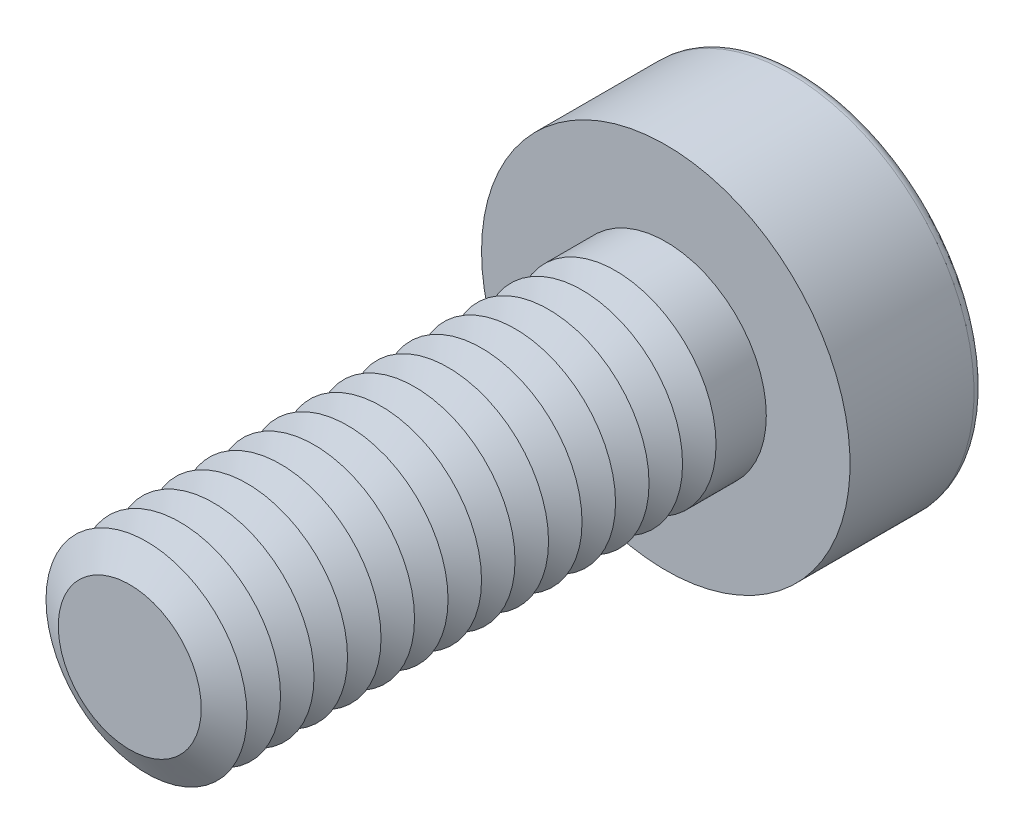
ISO-10303-21;
HEADER;
FILE_DESCRIPTION(('STEP AP214'),'2;1');
FILE_NAME('part.step','',(''),(''),'','','');
FILE_SCHEMA(('AUTOMOTIVE_DESIGN { 1 0 10303 214 1 1 1 1 }'));
ENDSEC;
DATA;
#1=APPLICATION_CONTEXT('core data for automotive mechanical design processes');
#2=APPLICATION_PROTOCOL_DEFINITION('international standard','automotive_design',2000,#1);
#3=PRODUCT_CONTEXT('',#1,'mechanical');
#4=PRODUCT('Part','Part','',(#3));
#5=PRODUCT_RELATED_PRODUCT_CATEGORY('part','',(#4));
#6=PRODUCT_DEFINITION_FORMATION('','',#4);
#7=PRODUCT_DEFINITION_CONTEXT('part definition',#1,'design');
#8=PRODUCT_DEFINITION('design','',#6,#7);
#9=PRODUCT_DEFINITION_SHAPE('','',#8);
#10=(LENGTH_UNIT() NAMED_UNIT(*) SI_UNIT(.MILLI.,.METRE.));
#11=(NAMED_UNIT(*) PLANE_ANGLE_UNIT() SI_UNIT($,.RADIAN.));
#12=(NAMED_UNIT(*) SI_UNIT($,.STERADIAN.) SOLID_ANGLE_UNIT());
#13=UNCERTAINTY_MEASURE_WITH_UNIT(LENGTH_MEASURE(1.E-05),#10,'distance_accuracy_value','');
#14=(GEOMETRIC_REPRESENTATION_CONTEXT(3) GLOBAL_UNCERTAINTY_ASSIGNED_CONTEXT((#13)) GLOBAL_UNIT_ASSIGNED_CONTEXT((#10,
#11,#12)) REPRESENTATION_CONTEXT('',''));
#15=CARTESIAN_POINT('',(0.,0.,0.));
#16=DIRECTION('',(0.,0.,1.));
#17=DIRECTION('',(1.,0.,0.));
#18=AXIS2_PLACEMENT_3D('',#15,#16,#17);
#19=CARTESIAN_POINT('',(0.,0.,6.25));
#20=DIRECTION('',(0.,0.,1.));
#21=DIRECTION('',(1.,0.,0.));
#22=AXIS2_PLACEMENT_3D('',#19,#20,#21);
#23=CONICAL_SURFACE('',#22,1.5,1.0471975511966);
#24=CARTESIAN_POINT('',(0.,0.,6.));
#25=DIRECTION('',(0.,0.,1.));
#26=DIRECTION('',(1.,0.,0.));
#27=AXIS2_PLACEMENT_3D('',#24,#25,#26);
#28=CIRCLE('',#27,1.06698729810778);
#29=CARTESIAN_POINT('',(1.06698729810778,0.,6.));
#30=VERTEX_POINT('',#29);
#31=EDGE_CURVE('E314',#30,#30,#28,.T.);
#32=ORIENTED_EDGE('',*,*,#31,.T.);
#33=EDGE_LOOP('',(#32));
#34=FACE_BOUND('',#33,.T.);
#35=CARTESIAN_POINT('',(0.,0.,6.25));
#36=DIRECTION('',(0.,0.,1.));
#37=DIRECTION('',(1.,0.,0.));
#38=AXIS2_PLACEMENT_3D('',#35,#36,#37);
#39=CIRCLE('',#38,1.5);
#40=CARTESIAN_POINT('',(1.5,0.,6.25));
#41=VERTEX_POINT('',#40);
#42=EDGE_CURVE('E316',#41,#41,#39,.T.);
#43=ORIENTED_EDGE('',*,*,#42,.F.);
#44=EDGE_LOOP('',(#43));
#45=FACE_BOUND('',#44,.T.);
#46=ADVANCED_FACE('F39',(#34,#45),#23,.T.);
#47=CARTESIAN_POINT('',(0.,0.,6.));
#48=DIRECTION('',(0.,0.,-1.));
#49=DIRECTION('',(-1.,0.,0.));
#50=AXIS2_PLACEMENT_3D('',#47,#48,#49);
#51=CONICAL_SURFACE('',#50,1.06698729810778,1.0471975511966);
#52=CARTESIAN_POINT('',(0.,0.,5.75));
#53=DIRECTION('',(0.,0.,1.));
#54=DIRECTION('',(1.,0.,0.));
#55=AXIS2_PLACEMENT_3D('',#52,#53,#54);
#56=CIRCLE('',#55,1.5);
#57=CARTESIAN_POINT('',(1.5,0.,5.75));
#58=VERTEX_POINT('',#57);
#59=EDGE_CURVE('E323',#58,#58,#56,.T.);
#60=ORIENTED_EDGE('',*,*,#59,.T.);
#61=EDGE_LOOP('',(#60));
#62=FACE_BOUND('',#61,.T.);
#63=ORIENTED_EDGE('',*,*,#31,.F.);
#64=EDGE_LOOP('',(#63));
#65=FACE_BOUND('',#64,.T.);
#66=ADVANCED_FACE('F245',(#62,#65),#51,.T.);
#67=CARTESIAN_POINT('',(0.,0.,8.));
#68=DIRECTION('',(0.,0.,1.));
#69=DIRECTION('',(1.,0.,0.));
#70=AXIS2_PLACEMENT_3D('',#67,#68,#69);
#71=PLANE('',#70);
#72=CARTESIAN_POINT('',(0.,0.,8.));
#73=DIRECTION('',(0.,0.,1.));
#74=DIRECTION('',(1.,0.,0.));
#75=AXIS2_PLACEMENT_3D('',#72,#73,#74);
#76=CIRCLE('',#75,1.06698729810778);
#77=CARTESIAN_POINT('',(1.06698729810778,0.,8.));
#78=VERTEX_POINT('',#77);
#79=EDGE_CURVE('E174',#78,#78,#76,.T.);
#80=ORIENTED_EDGE('',*,*,#79,.T.);
#81=EDGE_LOOP('',(#80));
#82=FACE_BOUND('',#81,.T.);
#83=ADVANCED_FACE('F251',(#82),#71,.T.);
#84=CARTESIAN_POINT('',(0.,0.,8.));
#85=DIRECTION('',(0.,0.,-1.));
#86=DIRECTION('',(-1.,0.,0.));
#87=AXIS2_PLACEMENT_3D('',#84,#85,#86);
#88=CONICAL_SURFACE('',#87,1.06698729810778,1.0471975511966);
#89=CARTESIAN_POINT('',(0.,0.,7.75));
#90=DIRECTION('',(0.,0.,1.));
#91=DIRECTION('',(1.,0.,0.));
#92=AXIS2_PLACEMENT_3D('',#89,#90,#91);
#93=CIRCLE('',#92,1.5);
#94=CARTESIAN_POINT('',(1.5,0.,7.75));
#95=VERTEX_POINT('',#94);
#96=EDGE_CURVE('E291',#95,#95,#93,.T.);
#97=ORIENTED_EDGE('',*,*,#96,.T.);
#98=EDGE_LOOP('',(#97));
#99=FACE_BOUND('',#98,.T.);
#100=ORIENTED_EDGE('',*,*,#79,.F.);
#101=EDGE_LOOP('',(#100));
#102=FACE_BOUND('',#101,.T.);
#103=ADVANCED_FACE('F199',(#99,#102),#88,.T.);
#104=CARTESIAN_POINT('',(0.,0.,7.75));
#105=DIRECTION('',(0.,0.,1.));
#106=DIRECTION('',(1.,0.,0.));
#107=AXIS2_PLACEMENT_3D('',#104,#105,#106);
#108=CONICAL_SURFACE('',#107,1.5,1.0471975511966);
#109=CARTESIAN_POINT('',(0.,0.,7.5));
#110=DIRECTION('',(0.,0.,1.));
#111=DIRECTION('',(1.,0.,0.));
#112=AXIS2_PLACEMENT_3D('',#109,#110,#111);
#113=CIRCLE('',#112,1.06698729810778);
#114=CARTESIAN_POINT('',(1.06698729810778,0.,7.5));
#115=VERTEX_POINT('',#114);
#116=EDGE_CURVE('E288',#115,#115,#113,.T.);
#117=ORIENTED_EDGE('',*,*,#116,.T.);
#118=EDGE_LOOP('',(#117));
#119=FACE_BOUND('',#118,.T.);
#120=ORIENTED_EDGE('',*,*,#96,.F.);
#121=EDGE_LOOP('',(#120));
#122=FACE_BOUND('',#121,.T.);
#123=ADVANCED_FACE('F277',(#119,#122),#108,.T.);
#124=CARTESIAN_POINT('',(0.,0.,7.5));
#125=DIRECTION('',(0.,0.,-1.));
#126=DIRECTION('',(-1.,0.,0.));
#127=AXIS2_PLACEMENT_3D('',#124,#125,#126);
#128=CONICAL_SURFACE('',#127,1.06698729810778,1.0471975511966);
#129=CARTESIAN_POINT('',(0.,0.,7.25));
#130=DIRECTION('',(0.,0.,1.));
#131=DIRECTION('',(1.,0.,0.));
#132=AXIS2_PLACEMENT_3D('',#129,#130,#131);
#133=CIRCLE('',#132,1.5);
#134=CARTESIAN_POINT('',(1.5,0.,7.25));
#135=VERTEX_POINT('',#134);
#136=EDGE_CURVE('E300',#135,#135,#133,.T.);
#137=ORIENTED_EDGE('',*,*,#136,.T.);
#138=EDGE_LOOP('',(#137));
#139=FACE_BOUND('',#138,.T.);
#140=ORIENTED_EDGE('',*,*,#116,.F.);
#141=EDGE_LOOP('',(#140));
#142=FACE_BOUND('',#141,.T.);
#143=ADVANCED_FACE('F274',(#139,#142),#128,.T.);
#144=CARTESIAN_POINT('',(0.,0.,7.25));
#145=DIRECTION('',(0.,0.,1.));
#146=DIRECTION('',(1.,0.,0.));
#147=AXIS2_PLACEMENT_3D('',#144,#145,#146);
#148=CONICAL_SURFACE('',#147,1.5,1.0471975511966);
#149=CARTESIAN_POINT('',(0.,0.,7.));
#150=DIRECTION('',(0.,0.,1.));
#151=DIRECTION('',(1.,0.,0.));
#152=AXIS2_PLACEMENT_3D('',#149,#150,#151);
#153=CIRCLE('',#152,1.06698729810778);
#154=CARTESIAN_POINT('',(1.06698729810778,0.,7.));
#155=VERTEX_POINT('',#154);
#156=EDGE_CURVE('E293',#155,#155,#153,.T.);
#157=ORIENTED_EDGE('',*,*,#156,.T.);
#158=EDGE_LOOP('',(#157));
#159=FACE_BOUND('',#158,.T.);
#160=ORIENTED_EDGE('',*,*,#136,.F.);
#161=EDGE_LOOP('',(#160));
#162=FACE_BOUND('',#161,.T.);
#163=ADVANCED_FACE('F270',(#159,#162),#148,.T.);
#164=CARTESIAN_POINT('',(0.,0.,7.));
#165=DIRECTION('',(0.,0.,-1.));
#166=DIRECTION('',(-1.,0.,0.));
#167=AXIS2_PLACEMENT_3D('',#164,#165,#166);
#168=CONICAL_SURFACE('',#167,1.06698729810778,1.0471975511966);
#169=CARTESIAN_POINT('',(0.,0.,6.75));
#170=DIRECTION('',(0.,0.,1.));
#171=DIRECTION('',(1.,0.,0.));
#172=AXIS2_PLACEMENT_3D('',#169,#170,#171);
#173=CIRCLE('',#172,1.5);
#174=CARTESIAN_POINT('',(1.5,0.,6.75));
#175=VERTEX_POINT('',#174);
#176=EDGE_CURVE('E310',#175,#175,#173,.T.);
#177=ORIENTED_EDGE('',*,*,#176,.T.);
#178=EDGE_LOOP('',(#177));
#179=FACE_BOUND('',#178,.T.);
#180=ORIENTED_EDGE('',*,*,#156,.F.);
#181=EDGE_LOOP('',(#180));
#182=FACE_BOUND('',#181,.T.);
#183=ADVANCED_FACE('F266',(#179,#182),#168,.T.);
#184=CARTESIAN_POINT('',(0.,0.,6.75));
#185=DIRECTION('',(0.,0.,1.));
#186=DIRECTION('',(1.,0.,0.));
#187=AXIS2_PLACEMENT_3D('',#184,#185,#186);
#188=CONICAL_SURFACE('',#187,1.5,1.0471975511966);
#189=CARTESIAN_POINT('',(0.,0.,6.5));
#190=DIRECTION('',(0.,0.,1.));
#191=DIRECTION('',(1.,0.,0.));
#192=AXIS2_PLACEMENT_3D('',#189,#190,#191);
#193=CIRCLE('',#192,1.06698729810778);
#194=CARTESIAN_POINT('',(1.06698729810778,0.,6.5));
#195=VERTEX_POINT('',#194);
#196=EDGE_CURVE('E306',#195,#195,#193,.T.);
#197=ORIENTED_EDGE('',*,*,#196,.T.);
#198=EDGE_LOOP('',(#197));
#199=FACE_BOUND('',#198,.T.);
#200=ORIENTED_EDGE('',*,*,#176,.F.);
#201=EDGE_LOOP('',(#200));
#202=FACE_BOUND('',#201,.T.);
#203=ADVANCED_FACE('F262',(#199,#202),#188,.T.);
#204=CARTESIAN_POINT('',(0.,0.,6.5));
#205=DIRECTION('',(0.,0.,-1.));
#206=DIRECTION('',(-1.,0.,0.));
#207=AXIS2_PLACEMENT_3D('',#204,#205,#206);
#208=CONICAL_SURFACE('',#207,1.06698729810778,1.0471975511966);
#209=ORIENTED_EDGE('',*,*,#42,.T.);
#210=EDGE_LOOP('',(#209));
#211=FACE_BOUND('',#210,.T.);
#212=ORIENTED_EDGE('',*,*,#196,.F.);
#213=EDGE_LOOP('',(#212));
#214=FACE_BOUND('',#213,.T.);
#215=ADVANCED_FACE('F258',(#211,#214),#208,.T.);
#216=CARTESIAN_POINT('',(0.,0.,5.75));
#217=DIRECTION('',(0.,0.,1.));
#218=DIRECTION('',(1.,0.,0.));
#219=AXIS2_PLACEMENT_3D('',#216,#217,#218);
#220=CONICAL_SURFACE('',#219,1.5,1.0471975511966);
#221=CARTESIAN_POINT('',(0.,0.,5.5));
#222=DIRECTION('',(0.,0.,1.));
#223=DIRECTION('',(1.,0.,0.));
#224=AXIS2_PLACEMENT_3D('',#221,#222,#223);
#225=CIRCLE('',#224,1.06698729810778);
#226=CARTESIAN_POINT('',(1.06698729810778,0.,5.5));
#227=VERTEX_POINT('',#226);
#228=EDGE_CURVE('E319',#227,#227,#225,.T.);
#229=ORIENTED_EDGE('',*,*,#228,.T.);
#230=EDGE_LOOP('',(#229));
#231=FACE_BOUND('',#230,.T.);
#232=ORIENTED_EDGE('',*,*,#59,.F.);
#233=EDGE_LOOP('',(#232));
#234=FACE_BOUND('',#233,.T.);
#235=ADVANCED_FACE('F261',(#231,#234),#220,.T.);
#236=CARTESIAN_POINT('',(0.,0.,5.5));
#237=DIRECTION('',(0.,0.,-1.));
#238=DIRECTION('',(-1.,0.,0.));
#239=AXIS2_PLACEMENT_3D('',#236,#237,#238);
#240=CONICAL_SURFACE('',#239,1.06698729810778,1.0471975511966);
#241=CARTESIAN_POINT('',(0.,0.,5.25));
#242=DIRECTION('',(0.,0.,1.));
#243=DIRECTION('',(1.,0.,0.));
#244=AXIS2_PLACEMENT_3D('',#241,#242,#243);
#245=CIRCLE('',#244,1.5);
#246=CARTESIAN_POINT('',(1.5,0.,5.25));
#247=VERTEX_POINT('',#246);
#248=EDGE_CURVE('E331',#247,#247,#245,.T.);
#249=ORIENTED_EDGE('',*,*,#248,.T.);
#250=EDGE_LOOP('',(#249));
#251=FACE_BOUND('',#250,.T.);
#252=ORIENTED_EDGE('',*,*,#228,.F.);
#253=EDGE_LOOP('',(#252));
#254=FACE_BOUND('',#253,.T.);
#255=ADVANCED_FACE('F479',(#251,#254),#240,.T.);
#256=CARTESIAN_POINT('',(0.,0.,5.25));
#257=DIRECTION('',(0.,0.,1.));
#258=DIRECTION('',(1.,0.,0.));
#259=AXIS2_PLACEMENT_3D('',#256,#257,#258);
#260=CONICAL_SURFACE('',#259,1.5,1.0471975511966);
#261=CARTESIAN_POINT('',(0.,0.,5.));
#262=DIRECTION('',(0.,0.,1.));
#263=DIRECTION('',(1.,0.,0.));
#264=AXIS2_PLACEMENT_3D('',#261,#262,#263);
#265=CIRCLE('',#264,1.06698729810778);
#266=CARTESIAN_POINT('',(1.06698729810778,0.,5.));
#267=VERTEX_POINT('',#266);
#268=EDGE_CURVE('E327',#267,#267,#265,.T.);
#269=ORIENTED_EDGE('',*,*,#268,.T.);
#270=EDGE_LOOP('',(#269));
#271=FACE_BOUND('',#270,.T.);
#272=ORIENTED_EDGE('',*,*,#248,.F.);
#273=EDGE_LOOP('',(#272));
#274=FACE_BOUND('',#273,.T.);
#275=ADVANCED_FACE('F475',(#271,#274),#260,.T.);
#276=CARTESIAN_POINT('',(0.,0.,5.));
#277=DIRECTION('',(0.,0.,-1.));
#278=DIRECTION('',(-1.,0.,0.));
#279=AXIS2_PLACEMENT_3D('',#276,#277,#278);
#280=CONICAL_SURFACE('',#279,1.06698729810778,1.0471975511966);
#281=CARTESIAN_POINT('',(0.,0.,4.75));
#282=DIRECTION('',(0.,0.,1.));
#283=DIRECTION('',(1.,0.,0.));
#284=AXIS2_PLACEMENT_3D('',#281,#282,#283);
#285=CIRCLE('',#284,1.5);
#286=CARTESIAN_POINT('',(1.5,0.,4.75));
#287=VERTEX_POINT('',#286);
#288=EDGE_CURVE('E339',#287,#287,#285,.T.);
#289=ORIENTED_EDGE('',*,*,#288,.T.);
#290=EDGE_LOOP('',(#289));
#291=FACE_BOUND('',#290,.T.);
#292=ORIENTED_EDGE('',*,*,#268,.F.);
#293=EDGE_LOOP('',(#292));
#294=FACE_BOUND('',#293,.T.);
#295=ADVANCED_FACE('F471',(#291,#294),#280,.T.);
#296=CARTESIAN_POINT('',(0.,0.,4.75));
#297=DIRECTION('',(0.,0.,1.));
#298=DIRECTION('',(1.,0.,0.));
#299=AXIS2_PLACEMENT_3D('',#296,#297,#298);
#300=CONICAL_SURFACE('',#299,1.5,1.0471975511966);
#301=CARTESIAN_POINT('',(0.,0.,4.5));
#302=DIRECTION('',(0.,0.,1.));
#303=DIRECTION('',(1.,0.,0.));
#304=AXIS2_PLACEMENT_3D('',#301,#302,#303);
#305=CIRCLE('',#304,1.06698729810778);
#306=CARTESIAN_POINT('',(1.06698729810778,0.,4.5));
#307=VERTEX_POINT('',#306);
#308=EDGE_CURVE('E335',#307,#307,#305,.T.);
#309=ORIENTED_EDGE('',*,*,#308,.T.);
#310=EDGE_LOOP('',(#309));
#311=FACE_BOUND('',#310,.T.);
#312=ORIENTED_EDGE('',*,*,#288,.F.);
#313=EDGE_LOOP('',(#312));
#314=FACE_BOUND('',#313,.T.);
#315=ADVANCED_FACE('F467',(#311,#314),#300,.T.);
#316=CARTESIAN_POINT('',(0.,0.,4.5));
#317=DIRECTION('',(0.,0.,-1.));
#318=DIRECTION('',(-1.,0.,0.));
#319=AXIS2_PLACEMENT_3D('',#316,#317,#318);
#320=CONICAL_SURFACE('',#319,1.06698729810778,1.0471975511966);
#321=CARTESIAN_POINT('',(0.,0.,4.25));
#322=DIRECTION('',(0.,0.,1.));
#323=DIRECTION('',(1.,0.,0.));
#324=AXIS2_PLACEMENT_3D('',#321,#322,#323);
#325=CIRCLE('',#324,1.5);
#326=CARTESIAN_POINT('',(1.5,0.,4.25));
#327=VERTEX_POINT('',#326);
#328=EDGE_CURVE('E347',#327,#327,#325,.T.);
#329=ORIENTED_EDGE('',*,*,#328,.T.);
#330=EDGE_LOOP('',(#329));
#331=FACE_BOUND('',#330,.T.);
#332=ORIENTED_EDGE('',*,*,#308,.F.);
#333=EDGE_LOOP('',(#332));
#334=FACE_BOUND('',#333,.T.);
#335=ADVANCED_FACE('F463',(#331,#334),#320,.T.);
#336=CARTESIAN_POINT('',(0.,0.,4.25));
#337=DIRECTION('',(0.,0.,1.));
#338=DIRECTION('',(1.,0.,0.));
#339=AXIS2_PLACEMENT_3D('',#336,#337,#338);
#340=CONICAL_SURFACE('',#339,1.5,1.0471975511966);
#341=CARTESIAN_POINT('',(0.,0.,4.));
#342=DIRECTION('',(0.,0.,1.));
#343=DIRECTION('',(1.,0.,0.));
#344=AXIS2_PLACEMENT_3D('',#341,#342,#343);
#345=CIRCLE('',#344,1.06698729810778);
#346=CARTESIAN_POINT('',(1.06698729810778,0.,4.));
#347=VERTEX_POINT('',#346);
#348=EDGE_CURVE('E343',#347,#347,#345,.T.);
#349=ORIENTED_EDGE('',*,*,#348,.T.);
#350=EDGE_LOOP('',(#349));
#351=FACE_BOUND('',#350,.T.);
#352=ORIENTED_EDGE('',*,*,#328,.F.);
#353=EDGE_LOOP('',(#352));
#354=FACE_BOUND('',#353,.T.);
#355=ADVANCED_FACE('F459',(#351,#354),#340,.T.);
#356=CARTESIAN_POINT('',(0.,0.,4.));
#357=DIRECTION('',(0.,0.,-1.));
#358=DIRECTION('',(-1.,0.,0.));
#359=AXIS2_PLACEMENT_3D('',#356,#357,#358);
#360=CONICAL_SURFACE('',#359,1.06698729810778,1.0471975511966);
#361=CARTESIAN_POINT('',(0.,0.,3.75));
#362=DIRECTION('',(0.,0.,1.));
#363=DIRECTION('',(1.,0.,0.));
#364=AXIS2_PLACEMENT_3D('',#361,#362,#363);
#365=CIRCLE('',#364,1.5);
#366=CARTESIAN_POINT('',(1.5,0.,3.75));
#367=VERTEX_POINT('',#366);
#368=EDGE_CURVE('E355',#367,#367,#365,.T.);
#369=ORIENTED_EDGE('',*,*,#368,.T.);
#370=EDGE_LOOP('',(#369));
#371=FACE_BOUND('',#370,.T.);
#372=ORIENTED_EDGE('',*,*,#348,.F.);
#373=EDGE_LOOP('',(#372));
#374=FACE_BOUND('',#373,.T.);
#375=ADVANCED_FACE('F455',(#371,#374),#360,.T.);
#376=CARTESIAN_POINT('',(0.,0.,3.75));
#377=DIRECTION('',(0.,0.,1.));
#378=DIRECTION('',(1.,0.,0.));
#379=AXIS2_PLACEMENT_3D('',#376,#377,#378);
#380=CONICAL_SURFACE('',#379,1.5,1.0471975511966);
#381=CARTESIAN_POINT('',(0.,0.,3.5));
#382=DIRECTION('',(0.,0.,1.));
#383=DIRECTION('',(1.,0.,0.));
#384=AXIS2_PLACEMENT_3D('',#381,#382,#383);
#385=CIRCLE('',#384,1.06698729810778);
#386=CARTESIAN_POINT('',(1.06698729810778,0.,3.5));
#387=VERTEX_POINT('',#386);
#388=EDGE_CURVE('E351',#387,#387,#385,.T.);
#389=ORIENTED_EDGE('',*,*,#388,.T.);
#390=EDGE_LOOP('',(#389));
#391=FACE_BOUND('',#390,.T.);
#392=ORIENTED_EDGE('',*,*,#368,.F.);
#393=EDGE_LOOP('',(#392));
#394=FACE_BOUND('',#393,.T.);
#395=ADVANCED_FACE('F451',(#391,#394),#380,.T.);
#396=CARTESIAN_POINT('',(0.,0.,3.5));
#397=DIRECTION('',(0.,0.,-1.));
#398=DIRECTION('',(-1.,0.,0.));
#399=AXIS2_PLACEMENT_3D('',#396,#397,#398);
#400=CONICAL_SURFACE('',#399,1.06698729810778,1.0471975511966);
#401=CARTESIAN_POINT('',(0.,0.,3.25));
#402=DIRECTION('',(0.,0.,1.));
#403=DIRECTION('',(1.,0.,0.));
#404=AXIS2_PLACEMENT_3D('',#401,#402,#403);
#405=CIRCLE('',#404,1.5);
#406=CARTESIAN_POINT('',(1.5,0.,3.25));
#407=VERTEX_POINT('',#406);
#408=EDGE_CURVE('E363',#407,#407,#405,.T.);
#409=ORIENTED_EDGE('',*,*,#408,.T.);
#410=EDGE_LOOP('',(#409));
#411=FACE_BOUND('',#410,.T.);
#412=ORIENTED_EDGE('',*,*,#388,.F.);
#413=EDGE_LOOP('',(#412));
#414=FACE_BOUND('',#413,.T.);
#415=ADVANCED_FACE('F447',(#411,#414),#400,.T.);
#416=CARTESIAN_POINT('',(0.,0.,3.25));
#417=DIRECTION('',(0.,0.,1.));
#418=DIRECTION('',(1.,0.,0.));
#419=AXIS2_PLACEMENT_3D('',#416,#417,#418);
#420=CONICAL_SURFACE('',#419,1.5,1.0471975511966);
#421=CARTESIAN_POINT('',(0.,0.,3.));
#422=DIRECTION('',(0.,0.,1.));
#423=DIRECTION('',(1.,0.,0.));
#424=AXIS2_PLACEMENT_3D('',#421,#422,#423);
#425=CIRCLE('',#424,1.06698729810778);
#426=CARTESIAN_POINT('',(1.06698729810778,0.,3.));
#427=VERTEX_POINT('',#426);
#428=EDGE_CURVE('E359',#427,#427,#425,.T.);
#429=ORIENTED_EDGE('',*,*,#428,.T.);
#430=EDGE_LOOP('',(#429));
#431=FACE_BOUND('',#430,.T.);
#432=ORIENTED_EDGE('',*,*,#408,.F.);
#433=EDGE_LOOP('',(#432));
#434=FACE_BOUND('',#433,.T.);
#435=ADVANCED_FACE('F443',(#431,#434),#420,.T.);
#436=CARTESIAN_POINT('',(0.,0.,3.));
#437=DIRECTION('',(0.,0.,-1.));
#438=DIRECTION('',(-1.,0.,0.));
#439=AXIS2_PLACEMENT_3D('',#436,#437,#438);
#440=CONICAL_SURFACE('',#439,1.06698729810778,1.0471975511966);
#441=CARTESIAN_POINT('',(0.,0.,2.75));
#442=DIRECTION('',(0.,0.,1.));
#443=DIRECTION('',(1.,0.,0.));
#444=AXIS2_PLACEMENT_3D('',#441,#442,#443);
#445=CIRCLE('',#444,1.5);
#446=CARTESIAN_POINT('',(1.5,0.,2.75));
#447=VERTEX_POINT('',#446);
#448=EDGE_CURVE('E371',#447,#447,#445,.T.);
#449=ORIENTED_EDGE('',*,*,#448,.T.);
#450=EDGE_LOOP('',(#449));
#451=FACE_BOUND('',#450,.T.);
#452=ORIENTED_EDGE('',*,*,#428,.F.);
#453=EDGE_LOOP('',(#452));
#454=FACE_BOUND('',#453,.T.);
#455=ADVANCED_FACE('F439',(#451,#454),#440,.T.);
#456=CARTESIAN_POINT('',(0.,0.,2.75));
#457=DIRECTION('',(0.,0.,1.));
#458=DIRECTION('',(1.,0.,0.));
#459=AXIS2_PLACEMENT_3D('',#456,#457,#458);
#460=CONICAL_SURFACE('',#459,1.5,1.0471975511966);
#461=CARTESIAN_POINT('',(0.,0.,2.5));
#462=DIRECTION('',(0.,0.,1.));
#463=DIRECTION('',(1.,0.,0.));
#464=AXIS2_PLACEMENT_3D('',#461,#462,#463);
#465=CIRCLE('',#464,1.06698729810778);
#466=CARTESIAN_POINT('',(1.06698729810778,0.,2.5));
#467=VERTEX_POINT('',#466);
#468=EDGE_CURVE('E367',#467,#467,#465,.T.);
#469=ORIENTED_EDGE('',*,*,#468,.T.);
#470=EDGE_LOOP('',(#469));
#471=FACE_BOUND('',#470,.T.);
#472=ORIENTED_EDGE('',*,*,#448,.F.);
#473=EDGE_LOOP('',(#472));
#474=FACE_BOUND('',#473,.T.);
#475=ADVANCED_FACE('F435',(#471,#474),#460,.T.);
#476=CARTESIAN_POINT('',(0.,0.,2.5));
#477=DIRECTION('',(0.,0.,-1.));
#478=DIRECTION('',(-1.,0.,0.));
#479=AXIS2_PLACEMENT_3D('',#476,#477,#478);
#480=CONICAL_SURFACE('',#479,1.06698729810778,1.0471975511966);
#481=CARTESIAN_POINT('',(0.,0.,2.25));
#482=DIRECTION('',(0.,0.,1.));
#483=DIRECTION('',(1.,0.,0.));
#484=AXIS2_PLACEMENT_3D('',#481,#482,#483);
#485=CIRCLE('',#484,1.5);
#486=CARTESIAN_POINT('',(1.5,0.,2.25));
#487=VERTEX_POINT('',#486);
#488=EDGE_CURVE('E379',#487,#487,#485,.T.);
#489=ORIENTED_EDGE('',*,*,#488,.T.);
#490=EDGE_LOOP('',(#489));
#491=FACE_BOUND('',#490,.T.);
#492=ORIENTED_EDGE('',*,*,#468,.F.);
#493=EDGE_LOOP('',(#492));
#494=FACE_BOUND('',#493,.T.);
#495=ADVANCED_FACE('F431',(#491,#494),#480,.T.);
#496=CARTESIAN_POINT('',(0.,0.,2.25));
#497=DIRECTION('',(0.,0.,1.));
#498=DIRECTION('',(1.,0.,0.));
#499=AXIS2_PLACEMENT_3D('',#496,#497,#498);
#500=CONICAL_SURFACE('',#499,1.5,1.0471975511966);
#501=CARTESIAN_POINT('',(0.,0.,2.));
#502=DIRECTION('',(0.,0.,1.));
#503=DIRECTION('',(1.,0.,0.));
#504=AXIS2_PLACEMENT_3D('',#501,#502,#503);
#505=CIRCLE('',#504,1.06698729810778);
#506=CARTESIAN_POINT('',(1.06698729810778,0.,2.));
#507=VERTEX_POINT('',#506);
#508=EDGE_CURVE('E375',#507,#507,#505,.T.);
#509=ORIENTED_EDGE('',*,*,#508,.T.);
#510=EDGE_LOOP('',(#509));
#511=FACE_BOUND('',#510,.T.);
#512=ORIENTED_EDGE('',*,*,#488,.F.);
#513=EDGE_LOOP('',(#512));
#514=FACE_BOUND('',#513,.T.);
#515=ADVANCED_FACE('F427',(#511,#514),#500,.T.);
#516=CARTESIAN_POINT('',(0.,0.,2.));
#517=DIRECTION('',(0.,0.,-1.));
#518=DIRECTION('',(-1.,0.,0.));
#519=AXIS2_PLACEMENT_3D('',#516,#517,#518);
#520=CONICAL_SURFACE('',#519,1.06698729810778,1.0471975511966);
#521=CARTESIAN_POINT('',(0.,0.,1.75));
#522=DIRECTION('',(0.,0.,1.));
#523=DIRECTION('',(1.,0.,0.));
#524=AXIS2_PLACEMENT_3D('',#521,#522,#523);
#525=CIRCLE('',#524,1.5);
#526=CARTESIAN_POINT('',(1.5,0.,1.75));
#527=VERTEX_POINT('',#526);
#528=EDGE_CURVE('E387',#527,#527,#525,.T.);
#529=ORIENTED_EDGE('',*,*,#528,.T.);
#530=EDGE_LOOP('',(#529));
#531=FACE_BOUND('',#530,.T.);
#532=ORIENTED_EDGE('',*,*,#508,.F.);
#533=EDGE_LOOP('',(#532));
#534=FACE_BOUND('',#533,.T.);
#535=ADVANCED_FACE('F423',(#531,#534),#520,.T.);
#536=CARTESIAN_POINT('',(0.,0.,1.75));
#537=DIRECTION('',(0.,0.,1.));
#538=DIRECTION('',(1.,0.,0.));
#539=AXIS2_PLACEMENT_3D('',#536,#537,#538);
#540=CONICAL_SURFACE('',#539,1.5,1.0471975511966);
#541=CARTESIAN_POINT('',(0.,0.,1.5));
#542=DIRECTION('',(0.,0.,1.));
#543=DIRECTION('',(1.,0.,0.));
#544=AXIS2_PLACEMENT_3D('',#541,#542,#543);
#545=CIRCLE('',#544,1.06698729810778);
#546=CARTESIAN_POINT('',(1.06698729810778,0.,1.5));
#547=VERTEX_POINT('',#546);
#548=EDGE_CURVE('E383',#547,#547,#545,.T.);
#549=ORIENTED_EDGE('',*,*,#548,.T.);
#550=EDGE_LOOP('',(#549));
#551=FACE_BOUND('',#550,.T.);
#552=ORIENTED_EDGE('',*,*,#528,.F.);
#553=EDGE_LOOP('',(#552));
#554=FACE_BOUND('',#553,.T.);
#555=ADVANCED_FACE('F418',(#551,#554),#540,.T.);
#556=CARTESIAN_POINT('',(0.,0.,1.5));
#557=DIRECTION('',(0.,0.,-1.));
#558=DIRECTION('',(-1.,0.,0.));
#559=AXIS2_PLACEMENT_3D('',#556,#557,#558);
#560=CONICAL_SURFACE('',#559,1.06698729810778,1.0471975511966);
#561=CARTESIAN_POINT('',(0.,0.,1.25));
#562=DIRECTION('',(0.,0.,1.));
#563=DIRECTION('',(1.,0.,0.));
#564=AXIS2_PLACEMENT_3D('',#561,#562,#563);
#565=CIRCLE('',#564,1.5);
#566=CARTESIAN_POINT('',(1.5,0.,1.25));
#567=VERTEX_POINT('',#566);
#568=EDGE_CURVE('E398',#567,#567,#565,.T.);
#569=ORIENTED_EDGE('',*,*,#568,.T.);
#570=EDGE_LOOP('',(#569));
#571=FACE_BOUND('',#570,.T.);
#572=ORIENTED_EDGE('',*,*,#548,.F.);
#573=EDGE_LOOP('',(#572));
#574=FACE_BOUND('',#573,.T.);
#575=ADVANCED_FACE('F404',(#571,#574),#560,.T.);
#576=CARTESIAN_POINT('',(0.,0.,1.25));
#577=DIRECTION('',(0.,0.,1.));
#578=DIRECTION('',(1.,0.,0.));
#579=AXIS2_PLACEMENT_3D('',#576,#577,#578);
#580=CONICAL_SURFACE('',#579,1.5,1.0471975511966);
#581=CARTESIAN_POINT('',(0.,0.,1.));
#582=DIRECTION('',(0.,0.,1.));
#583=DIRECTION('',(1.,0.,0.));
#584=AXIS2_PLACEMENT_3D('',#581,#582,#583);
#585=CIRCLE('',#584,1.06698729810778);
#586=CARTESIAN_POINT('',(1.06698729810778,0.,1.));
#587=VERTEX_POINT('',#586);
#588=EDGE_CURVE('E391',#587,#587,#585,.T.);
#589=ORIENTED_EDGE('',*,*,#588,.T.);
#590=EDGE_LOOP('',(#589));
#591=FACE_BOUND('',#590,.T.);
#592=ORIENTED_EDGE('',*,*,#568,.F.);
#593=EDGE_LOOP('',(#592));
#594=FACE_BOUND('',#593,.T.);
#595=ADVANCED_FACE('F407',(#591,#594),#580,.T.);
#596=CARTESIAN_POINT('',(0.,0.,1.));
#597=DIRECTION('',(0.,0.,-1.));
#598=DIRECTION('',(-1.,0.,0.));
#599=AXIS2_PLACEMENT_3D('',#596,#597,#598);
#600=CONICAL_SURFACE('',#599,1.06698729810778,1.0471975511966);
#601=CARTESIAN_POINT('',(0.,0.,0.75));
#602=DIRECTION('',(0.,0.,1.));
#603=DIRECTION('',(1.,0.,0.));
#604=AXIS2_PLACEMENT_3D('',#601,#602,#603);
#605=CIRCLE('',#604,1.5);
#606=CARTESIAN_POINT('',(1.5,0.,0.75));
#607=VERTEX_POINT('',#606);
#608=EDGE_CURVE('E395',#607,#607,#605,.T.);
#609=ORIENTED_EDGE('',*,*,#608,.T.);
#610=EDGE_LOOP('',(#609));
#611=FACE_BOUND('',#610,.T.);
#612=ORIENTED_EDGE('',*,*,#588,.F.);
#613=EDGE_LOOP('',(#612));
#614=FACE_BOUND('',#613,.T.);
#615=ADVANCED_FACE('F409',(#611,#614),#600,.T.);
#616=CARTESIAN_POINT('',(0.,0.,-0.5));
#617=DIRECTION('',(0.,0.,-1.));
#618=DIRECTION('',(-1.,0.,0.));
#619=AXIS2_PLACEMENT_3D('',#616,#617,#618);
#620=CONICAL_SURFACE('',#619,0.999999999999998,1.0471975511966);
#621=CARTESIAN_POINT('',(0.,0.,0.0773502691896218));
#622=VERTEX_POINT('',#621);
#623=VERTEX_LOOP('',#622);
#624=FACE_BOUND('',#623,.T.);
#625=CARTESIAN_POINT('',(0.,0.,-0.5));
#626=DIRECTION('',(0.,0.,-1.));
#627=DIRECTION('',(-1.,0.,0.));
#628=AXIS2_PLACEMENT_3D('',#625,#626,#627);
#629=CIRCLE('',#628,0.999999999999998);
#630=CARTESIAN_POINT('',(-0.866025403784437,0.499999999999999,-0.5));
#631=VERTEX_POINT('',#630);
#632=CARTESIAN_POINT('',(0.,0.999999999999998,-0.5));
#633=VERTEX_POINT('',#632);
#634=EDGE_CURVE('E149',#631,#633,#629,.T.);
#635=ORIENTED_EDGE('',*,*,#634,.T.);
#636=CARTESIAN_POINT('',(0.,0.,-0.5));
#637=DIRECTION('',(0.,0.,-1.));
#638=DIRECTION('',(-1.,0.,0.));
#639=AXIS2_PLACEMENT_3D('',#636,#637,#638);
#640=CIRCLE('',#639,0.999999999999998);
#641=CARTESIAN_POINT('',(0.866025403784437,0.499999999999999,-0.5));
#642=VERTEX_POINT('',#641);
#643=EDGE_CURVE('E54',#633,#642,#640,.T.);
#644=ORIENTED_EDGE('',*,*,#643,.T.);
#645=CARTESIAN_POINT('',(0.866025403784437,-0.499999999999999,-0.5));
#646=VERTEX_POINT('',#645);
#647=EDGE_CURVE('E968',#642,#646,#640,.T.);
#648=ORIENTED_EDGE('',*,*,#647,.T.);
#649=CARTESIAN_POINT('',(0.,-0.999999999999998,-0.5));
#650=VERTEX_POINT('',#649);
#651=EDGE_CURVE('E966',#646,#650,#640,.T.);
#652=ORIENTED_EDGE('',*,*,#651,.T.);
#653=CARTESIAN_POINT('',(-0.866025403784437,-0.499999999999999,-0.5));
#654=VERTEX_POINT('',#653);
#655=EDGE_CURVE('E960',#650,#654,#640,.T.);
#656=ORIENTED_EDGE('',*,*,#655,.T.);
#657=EDGE_CURVE('E958',#654,#631,#640,.T.);
#658=ORIENTED_EDGE('',*,*,#657,.T.);
#659=EDGE_LOOP('',(#635,#644,#648,#652,#656,#658));
#660=FACE_BOUND('',#659,.T.);
#661=ADVANCED_FACE('F201',(#624,#660),#620,.F.);
#662=CARTESIAN_POINT('',(0.,0.,-0.5));
#663=DIRECTION('',(0.,0.,-1.));
#664=DIRECTION('',(-1.,0.,0.));
#665=AXIS2_PLACEMENT_3D('',#662,#663,#664);
#666=PLANE('',#665);
#667=ORIENTED_EDGE('',*,*,#643,.F.);
#668=DIRECTION('',(1.,0.,0.));
#669=VECTOR('',#668,1.);
#670=CARTESIAN_POINT('',(-0.577350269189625,1.,-0.5));
#671=LINE('',#670,#669);
#672=CARTESIAN_POINT('',(0.577350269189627,1.,-0.5));
#673=VERTEX_POINT('',#672);
#674=EDGE_CURVE('E1007',#633,#673,#671,.T.);
#675=ORIENTED_EDGE('',*,*,#674,.T.);
#676=DIRECTION('',(0.5,-0.866025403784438,0.));
#677=VECTOR('',#676,1.);
#678=CARTESIAN_POINT('',(0.577350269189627,1.,-0.5));
#679=LINE('',#678,#677);
#680=EDGE_CURVE('E155',#673,#642,#679,.T.);
#681=ORIENTED_EDGE('',*,*,#680,.T.);
#682=EDGE_LOOP('',(#667,#675,#681));
#683=FACE_BOUND('',#682,.T.);
#684=ADVANCED_FACE('F562',(#683),#666,.T.);
#685=ORIENTED_EDGE('',*,*,#647,.F.);
#686=CARTESIAN_POINT('',(1.15470053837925,0.,-0.5));
#687=VERTEX_POINT('',#686);
#688=EDGE_CURVE('E1010',#642,#687,#679,.T.);
#689=ORIENTED_EDGE('',*,*,#688,.T.);
#690=DIRECTION('',(-0.5,-0.866025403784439,0.));
#691=VECTOR('',#690,1.);
#692=CARTESIAN_POINT('',(1.15470053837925,0.,-0.5));
#693=LINE('',#692,#691);
#694=EDGE_CURVE('E982',#687,#646,#693,.T.);
#695=ORIENTED_EDGE('',*,*,#694,.T.);
#696=EDGE_LOOP('',(#685,#689,#695));
#697=FACE_BOUND('',#696,.T.);
#698=ADVANCED_FACE('F572',(#697),#666,.T.);
#699=ORIENTED_EDGE('',*,*,#651,.F.);
#700=CARTESIAN_POINT('',(0.577350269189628,-1.,-0.5));
#701=VERTEX_POINT('',#700);
#702=EDGE_CURVE('E984',#646,#701,#693,.T.);
#703=ORIENTED_EDGE('',*,*,#702,.T.);
#704=DIRECTION('',(-1.,0.,0.));
#705=VECTOR('',#704,1.);
#706=CARTESIAN_POINT('',(0.577350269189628,-1.,-0.5));
#707=LINE('',#706,#705);
#708=EDGE_CURVE('E932',#701,#650,#707,.T.);
#709=ORIENTED_EDGE('',*,*,#708,.T.);
#710=EDGE_LOOP('',(#699,#703,#709));
#711=FACE_BOUND('',#710,.T.);
#712=ADVANCED_FACE('F582',(#711),#666,.T.);
#713=ORIENTED_EDGE('',*,*,#655,.F.);
#714=CARTESIAN_POINT('',(-0.577350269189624,-0.999999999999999,-0.5));
#715=VERTEX_POINT('',#714);
#716=EDGE_CURVE('E978',#650,#715,#707,.T.);
#717=ORIENTED_EDGE('',*,*,#716,.T.);
#718=DIRECTION('',(-0.5,0.866025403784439,0.));
#719=VECTOR('',#718,1.);
#720=CARTESIAN_POINT('',(-0.577350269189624,-0.999999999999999,-0.5));
#721=LINE('',#720,#719);
#722=EDGE_CURVE('E980',#715,#654,#721,.T.);
#723=ORIENTED_EDGE('',*,*,#722,.T.);
#724=EDGE_LOOP('',(#713,#717,#723));
#725=FACE_BOUND('',#724,.T.);
#726=ADVANCED_FACE('F590',(#725),#666,.T.);
#727=ORIENTED_EDGE('',*,*,#657,.F.);
#728=CARTESIAN_POINT('',(-1.15470053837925,0.,-0.5));
#729=VERTEX_POINT('',#728);
#730=EDGE_CURVE('E985',#654,#729,#721,.T.);
#731=ORIENTED_EDGE('',*,*,#730,.T.);
#732=DIRECTION('',(0.5,0.866025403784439,0.));
#733=VECTOR('',#732,1.);
#734=CARTESIAN_POINT('',(-1.15470053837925,0.,-0.5));
#735=LINE('',#734,#733);
#736=EDGE_CURVE('E158',#729,#631,#735,.T.);
#737=ORIENTED_EDGE('',*,*,#736,.T.);
#738=EDGE_LOOP('',(#727,#731,#737));
#739=FACE_BOUND('',#738,.T.);
#740=ADVANCED_FACE('F231',(#739),#666,.T.);
#741=ORIENTED_EDGE('',*,*,#634,.F.);
#742=CARTESIAN_POINT('',(-0.577350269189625,1.,-0.5));
#743=VERTEX_POINT('',#742);
#744=EDGE_CURVE('E991',#631,#743,#735,.T.);
#745=ORIENTED_EDGE('',*,*,#744,.T.);
#746=EDGE_CURVE('E1005',#743,#633,#671,.T.);
#747=ORIENTED_EDGE('',*,*,#746,.T.);
#748=EDGE_LOOP('',(#741,#745,#747));
#749=FACE_BOUND('',#748,.T.);
#750=ADVANCED_FACE('F574',(#749),#666,.T.);
#751=CARTESIAN_POINT('',(-0.577350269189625,1.,-0.5));
#752=DIRECTION('',(0.,1.,0.));
#753=DIRECTION('',(0.,0.,1.));
#754=AXIS2_PLACEMENT_3D('',#751,#752,#753);
#755=PLANE('',#754);
#756=DIRECTION('',(0.,0.,-1.));
#757=VECTOR('',#756,1.);
#758=CARTESIAN_POINT('',(-0.577350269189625,1.,-0.5));
#759=LINE('',#758,#757);
#760=CARTESIAN_POINT('',(-0.577350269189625,1.,-2.));
#761=VERTEX_POINT('',#760);
#762=EDGE_CURVE('E147',#743,#761,#759,.T.);
#763=ORIENTED_EDGE('',*,*,#762,.T.);
#764=CARTESIAN_POINT('',(-1.50720379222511,1.,-2.17525844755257));
#765=CARTESIAN_POINT('',(-1.46204888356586,1.,-2.16517814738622));
#766=CARTESIAN_POINT('',(-1.41686530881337,1.,-2.15522625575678));
#767=CARTESIAN_POINT('',(-1.32642642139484,1.,-2.13564428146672));
#768=CARTESIAN_POINT('',(-1.28117110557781,1.,-2.12601421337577));
#769=CARTESIAN_POINT('',(-1.14519006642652,1.,-2.09768643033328));
#770=CARTESIAN_POINT('',(-1.05434091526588,1.,-2.07957187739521));
#771=CARTESIAN_POINT('',(-0.87298578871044,1.,-2.04585879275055));
#772=CARTESIAN_POINT('',(-0.782483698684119,1.,-2.03023975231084));
#773=CARTESIAN_POINT('',(-0.600935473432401,1.,-2.00256781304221));
#774=CARTESIAN_POINT('',(-0.509889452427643,1.,-1.99051419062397));
#775=CARTESIAN_POINT('',(-0.326198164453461,1.,-1.9715245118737));
#776=CARTESIAN_POINT('',(-0.233546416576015,1.,-1.96464740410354));
#777=CARTESIAN_POINT('',(-0.0480110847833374,1.,-1.95773316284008));
#778=CARTESIAN_POINT('',(0.0448723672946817,1.,-1.95769276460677));
#779=CARTESIAN_POINT('',(0.230753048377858,1.,-1.96446847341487));
#780=CARTESIAN_POINT('',(0.323749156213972,1.,-1.97131296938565));
#781=CARTESIAN_POINT('',(0.509217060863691,1.,-1.99040362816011));
#782=CARTESIAN_POINT('',(0.601688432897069,1.,-2.00265366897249));
#783=CARTESIAN_POINT('',(0.788469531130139,1.,-2.0311825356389));
#784=CARTESIAN_POINT('',(0.882763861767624,1.,-2.04755860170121));
#785=CARTESIAN_POINT('',(1.07089474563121,1.,-2.08278522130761));
#786=CARTESIAN_POINT('',(1.16473122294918,1.,-2.1016361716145));
#787=CARTESIAN_POINT('',(1.35209202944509,1.,-2.14094224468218));
#788=CARTESIAN_POINT('',(1.44561626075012,1.,-2.16139782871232));
#789=CARTESIAN_POINT('',(1.63242626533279,1.,-2.20337233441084));
#790=CARTESIAN_POINT('',(1.72571203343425,1.,-2.22489127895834));
#791=CARTESIAN_POINT('',(1.91097396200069,1.,-2.26839206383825));
#792=CARTESIAN_POINT('',(2.00295221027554,1.,-2.29036504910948));
#793=CARTESIAN_POINT('',(2.18678775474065,1.,-2.3348190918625));
#794=CARTESIAN_POINT('',(2.27864504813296,1.,-2.35730016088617));
#795=CARTESIAN_POINT('',(2.46214009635,1.,-2.40260092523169));
#796=CARTESIAN_POINT('',(2.55377797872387,1.,-2.42542010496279));
#797=CARTESIAN_POINT('',(2.73697957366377,1.,-2.47134052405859));
#798=CARTESIAN_POINT('',(2.82854328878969,1.,-2.49444175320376));
#799=CARTESIAN_POINT('',(2.92008180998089,1.,-2.51764127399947));
#800=B_SPLINE_CURVE_WITH_KNOTS('',3,(#764,#765,#766,#767,#768,#769,#770,#771,#772,#773,#774,
#775,#776,#777,#778,#779,#780,#781,#782,#783,#784,#785,#786,#787,#788,#789,#790,#791,#792,#793,
#794,#795,#796,#797,#798,#799),.UNSPECIFIED.,.F.,.F.,(4,2,2,2,2,2,2,2,2,2,2,2,2,2,2,2,2,4),(0.,
0.138798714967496,0.277603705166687,0.555495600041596,0.830971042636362,1.106390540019,
1.38490086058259,1.66327818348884,1.94280808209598,2.22253884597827,2.50960639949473,
2.79672003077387,3.08391650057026,3.37111915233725,3.65481652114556,3.93852034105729,
4.22182877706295,4.50512697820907),.UNSPECIFIED.);
#801=CARTESIAN_POINT('',(0.577350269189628,0.999999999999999,-2.));
#802=VERTEX_POINT('',#801);
#803=EDGE_CURVE('E124',#761,#802,#800,.T.);
#804=ORIENTED_EDGE('',*,*,#803,.T.);
#805=DIRECTION('',(0.,0.,-1.));
#806=VECTOR('',#805,1.);
#807=CARTESIAN_POINT('',(0.577350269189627,1.,-0.5));
#808=LINE('',#807,#806);
#809=EDGE_CURVE('E143',#673,#802,#808,.T.);
#810=ORIENTED_EDGE('',*,*,#809,.F.);
#811=ORIENTED_EDGE('',*,*,#674,.F.);
#812=ORIENTED_EDGE('',*,*,#746,.F.);
#813=EDGE_LOOP('',(#763,#804,#810,#811,#812));
#814=FACE_BOUND('',#813,.T.);
#815=ADVANCED_FACE('F141',(#814),#755,.F.);
#816=CARTESIAN_POINT('',(0.577350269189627,1.,-0.5));
#817=DIRECTION('',(0.866025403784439,0.5,0.));
#818=DIRECTION('',(-0.5,0.866025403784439,0.));
#819=AXIS2_PLACEMENT_3D('',#816,#817,#818);
#820=PLANE('',#819);
#821=ORIENTED_EDGE('',*,*,#809,.T.);
#822=CARTESIAN_POINT('',(0.577234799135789,1.0002,-2.00003094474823));
#823=CARTESIAN_POINT('',(0.601220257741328,0.958655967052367,-1.99359970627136));
#824=CARTESIAN_POINT('',(0.625249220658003,0.917036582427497,-1.98776108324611));
#825=CARTESIAN_POINT('',(0.673392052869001,0.833650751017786,-1.97750302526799));
#826=CARTESIAN_POINT('',(0.697505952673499,0.79188425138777,-1.97308416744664));
#827=CARTESIAN_POINT('',(0.745672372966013,0.70845756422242,-1.96592373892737));
#828=CARTESIAN_POINT('',(0.769724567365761,0.666797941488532,-1.96317362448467));
#829=CARTESIAN_POINT('',(0.817859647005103,0.583425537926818,-1.95948598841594));
#830=CARTESIAN_POINT('',(0.841942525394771,0.541712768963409,-1.95854811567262));
#831=CARTESIAN_POINT('',(0.890108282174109,0.458287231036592,-1.95854811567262));
#832=CARTESIAN_POINT('',(0.914191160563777,0.416574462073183,-1.95948598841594));
#833=CARTESIAN_POINT('',(0.962326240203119,0.33320205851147,-1.96317362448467));
#834=CARTESIAN_POINT('',(0.986378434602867,0.291542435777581,-1.96592373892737));
#835=CARTESIAN_POINT('',(1.03454485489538,0.208115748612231,-1.97308416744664));
#836=CARTESIAN_POINT('',(1.05865875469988,0.166349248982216,-1.97750302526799));
#837=CARTESIAN_POINT('',(1.10680158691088,0.0829634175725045,-1.98776108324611));
#838=CARTESIAN_POINT('',(1.13083054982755,0.0413440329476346,-1.99359970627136));
#839=CARTESIAN_POINT('',(1.15481600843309,-0.000199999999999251,-2.00003094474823));
#840=B_SPLINE_CURVE_WITH_KNOTS('',3,(#822,#823,#824,#825,#826,#827,#828,#829,#830,#831,#832,
#833,#834,#835,#836,#837,#838,#839),.UNSPECIFIED.,.F.,.F.,(4,2,2,2,2,2,2,2,4),(0.,
0.145207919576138,0.290474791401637,0.434991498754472,0.579480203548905,0.723968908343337,
0.868485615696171,1.01375248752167,1.15896040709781),.UNSPECIFIED.);
#841=CARTESIAN_POINT('',(1.15470053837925,0.,-2.));
#842=VERTEX_POINT('',#841);
#843=EDGE_CURVE('E11',#802,#842,#840,.T.);
#844=ORIENTED_EDGE('',*,*,#843,.T.);
#845=DIRECTION('',(0.,0.,-1.));
#846=VECTOR('',#845,1.);
#847=CARTESIAN_POINT('',(1.15470053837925,0.,-0.5));
#848=LINE('',#847,#846);
#849=EDGE_CURVE('E157',#687,#842,#848,.T.);
#850=ORIENTED_EDGE('',*,*,#849,.F.);
#851=ORIENTED_EDGE('',*,*,#688,.F.);
#852=ORIENTED_EDGE('',*,*,#680,.F.);
#853=EDGE_LOOP('',(#821,#844,#850,#851,#852));
#854=FACE_BOUND('',#853,.T.);
#855=ADVANCED_FACE('F152',(#854),#820,.F.);
#856=CARTESIAN_POINT('',(1.15470053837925,0.,-0.5));
#857=DIRECTION('',(0.866025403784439,-0.5,0.));
#858=DIRECTION('',(0.5,0.866025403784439,0.));
#859=AXIS2_PLACEMENT_3D('',#856,#857,#858);
#860=PLANE('',#859);
#861=ORIENTED_EDGE('',*,*,#849,.T.);
#862=CARTESIAN_POINT('',(1.15481600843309,0.000200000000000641,-2.00003094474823));
#863=CARTESIAN_POINT('',(1.13083054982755,-0.0413440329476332,-1.99359970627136));
#864=CARTESIAN_POINT('',(1.10680158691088,-0.0829634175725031,-1.98776108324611));
#865=CARTESIAN_POINT('',(1.05865875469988,-0.166349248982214,-1.97750302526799));
#866=CARTESIAN_POINT('',(1.03454485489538,-0.20811574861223,-1.97308416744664));
#867=CARTESIAN_POINT('',(0.986378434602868,-0.29154243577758,-1.96592373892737));
#868=CARTESIAN_POINT('',(0.962326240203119,-0.333202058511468,-1.96317362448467));
#869=CARTESIAN_POINT('',(0.914191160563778,-0.416574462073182,-1.95948598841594));
#870=CARTESIAN_POINT('',(0.890108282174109,-0.458287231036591,-1.95854811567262));
#871=CARTESIAN_POINT('',(0.841942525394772,-0.541712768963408,-1.95854811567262));
#872=CARTESIAN_POINT('',(0.817859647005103,-0.583425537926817,-1.95948598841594));
#873=CARTESIAN_POINT('',(0.769724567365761,-0.66679794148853,-1.96317362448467));
#874=CARTESIAN_POINT('',(0.745672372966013,-0.708457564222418,-1.96592373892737));
#875=CARTESIAN_POINT('',(0.6975059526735,-0.791884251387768,-1.97308416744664));
#876=CARTESIAN_POINT('',(0.673392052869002,-0.833650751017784,-1.97750302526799));
#877=CARTESIAN_POINT('',(0.625249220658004,-0.917036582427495,-1.98776108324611));
#878=CARTESIAN_POINT('',(0.601220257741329,-0.958655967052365,-1.99359970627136));
#879=CARTESIAN_POINT('',(0.57723479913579,-1.0002,-2.00003094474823));
#880=B_SPLINE_CURVE_WITH_KNOTS('',3,(#862,#863,#864,#865,#866,#867,#868,#869,#870,#871,#872,
#873,#874,#875,#876,#877,#878,#879),.UNSPECIFIED.,.F.,.F.,(4,2,2,2,2,2,2,2,4),(0.,
0.145207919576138,0.290474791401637,0.434991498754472,0.579480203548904,0.723968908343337,
0.868485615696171,1.01375248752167,1.15896040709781),.UNSPECIFIED.);
#881=CARTESIAN_POINT('',(0.577350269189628,-0.999999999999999,-2.));
#882=VERTEX_POINT('',#881);
#883=EDGE_CURVE('E173',#842,#882,#880,.T.);
#884=ORIENTED_EDGE('',*,*,#883,.T.);
#885=DIRECTION('',(0.,0.,-1.));
#886=VECTOR('',#885,1.);
#887=CARTESIAN_POINT('',(0.577350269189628,-1.,-0.5));
#888=LINE('',#887,#886);
#889=EDGE_CURVE('E927',#701,#882,#888,.T.);
#890=ORIENTED_EDGE('',*,*,#889,.F.);
#891=ORIENTED_EDGE('',*,*,#702,.F.);
#892=ORIENTED_EDGE('',*,*,#694,.F.);
#893=EDGE_LOOP('',(#861,#884,#890,#891,#892));
#894=FACE_BOUND('',#893,.T.);
#895=ADVANCED_FACE('F191',(#894),#860,.F.);
#896=CARTESIAN_POINT('',(0.577350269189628,-1.,-0.5));
#897=DIRECTION('',(0.,-1.,0.));
#898=DIRECTION('',(1.,0.,0.));
#899=AXIS2_PLACEMENT_3D('',#896,#897,#898);
#900=PLANE('',#899);
#901=ORIENTED_EDGE('',*,*,#889,.T.);
#902=CARTESIAN_POINT('',(-1.50720379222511,-0.999999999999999,-2.17525844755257));
#903=CARTESIAN_POINT('',(-1.46204888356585,-0.999999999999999,-2.16517814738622));
#904=CARTESIAN_POINT('',(-1.41686530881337,-0.999999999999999,-2.15522625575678));
#905=CARTESIAN_POINT('',(-1.32642642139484,-0.999999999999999,-2.13564428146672));
#906=CARTESIAN_POINT('',(-1.28117110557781,-0.999999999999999,-2.12601421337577));
#907=CARTESIAN_POINT('',(-1.14519006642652,-0.999999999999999,-2.09768643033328));
#908=CARTESIAN_POINT('',(-1.05434091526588,-0.999999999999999,-2.07957187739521));
#909=CARTESIAN_POINT('',(-0.87298578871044,-0.999999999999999,-2.04585879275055));
#910=CARTESIAN_POINT('',(-0.782483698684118,-0.999999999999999,-2.03023975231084));
#911=CARTESIAN_POINT('',(-0.600935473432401,-0.999999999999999,-2.00256781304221));
#912=CARTESIAN_POINT('',(-0.509889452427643,-0.999999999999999,-1.99051419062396));
#913=CARTESIAN_POINT('',(-0.326198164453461,-0.999999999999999,-1.9715245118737));
#914=CARTESIAN_POINT('',(-0.233546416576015,-0.999999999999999,-1.96464740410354));
#915=CARTESIAN_POINT('',(-0.0480110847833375,-0.999999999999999,-1.95773316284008));
#916=CARTESIAN_POINT('',(0.0448723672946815,-0.999999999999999,-1.95769276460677));
#917=CARTESIAN_POINT('',(0.230753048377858,-0.999999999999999,-1.96446847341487));
#918=CARTESIAN_POINT('',(0.323749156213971,-1.,-1.97131296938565));
#919=CARTESIAN_POINT('',(0.50921706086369,-1.,-1.99040362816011));
#920=CARTESIAN_POINT('',(0.601688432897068,-1.,-2.00265366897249));
#921=CARTESIAN_POINT('',(0.788469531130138,-1.,-2.0311825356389));
#922=CARTESIAN_POINT('',(0.882763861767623,-1.,-2.04755860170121));
#923=CARTESIAN_POINT('',(1.07089474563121,-1.,-2.08278522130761));
#924=CARTESIAN_POINT('',(1.16473122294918,-1.,-2.1016361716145));
#925=CARTESIAN_POINT('',(1.35209202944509,-1.,-2.14094224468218));
#926=CARTESIAN_POINT('',(1.44561626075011,-1.,-2.16139782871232));
#927=CARTESIAN_POINT('',(1.63242626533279,-1.,-2.20337233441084));
#928=CARTESIAN_POINT('',(1.72571203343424,-1.,-2.22489127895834));
#929=CARTESIAN_POINT('',(1.91097396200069,-1.,-2.26839206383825));
#930=CARTESIAN_POINT('',(2.00295221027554,-1.,-2.29036504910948));
#931=CARTESIAN_POINT('',(2.18678775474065,-1.,-2.3348190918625));
#932=CARTESIAN_POINT('',(2.27864504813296,-1.,-2.35730016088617));
#933=CARTESIAN_POINT('',(2.46214009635,-1.,-2.40260092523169));
#934=CARTESIAN_POINT('',(2.55377797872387,-1.,-2.42542010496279));
#935=CARTESIAN_POINT('',(2.73697957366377,-1.,-2.47134052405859));
#936=CARTESIAN_POINT('',(2.82854328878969,-1.,-2.49444175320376));
#937=CARTESIAN_POINT('',(2.92008180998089,-1.,-2.51764127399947));
#938=B_SPLINE_CURVE_WITH_KNOTS('',3,(#902,#903,#904,#905,#906,#907,#908,#909,#910,#911,#912,
#913,#914,#915,#916,#917,#918,#919,#920,#921,#922,#923,#924,#925,#926,#927,#928,#929,#930,#931,
#932,#933,#934,#935,#936,#937),.UNSPECIFIED.,.F.,.F.,(4,2,2,2,2,2,2,2,2,2,2,2,2,2,2,2,2,4),(0.,
0.138798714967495,0.277603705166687,0.555495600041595,0.83097104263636,1.106390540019,
1.38490086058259,1.66327818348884,1.94280808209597,2.22253884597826,2.50960639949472,
2.79672003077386,3.08391650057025,3.37111915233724,3.65481652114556,3.93852034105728,
4.22182877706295,4.50512697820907),.UNSPECIFIED.);
#939=CARTESIAN_POINT('',(-0.577350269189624,-0.999999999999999,-2.));
#940=VERTEX_POINT('',#939);
#941=EDGE_CURVE('E184',#882,#940,#938,.F.);
#942=ORIENTED_EDGE('',*,*,#941,.T.);
#943=DIRECTION('',(0.,0.,-1.));
#944=VECTOR('',#943,1.);
#945=CARTESIAN_POINT('',(-0.577350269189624,-0.999999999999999,-0.5));
#946=LINE('',#945,#944);
#947=EDGE_CURVE('E934',#715,#940,#946,.T.);
#948=ORIENTED_EDGE('',*,*,#947,.F.);
#949=ORIENTED_EDGE('',*,*,#716,.F.);
#950=ORIENTED_EDGE('',*,*,#708,.F.);
#951=EDGE_LOOP('',(#901,#942,#948,#949,#950));
#952=FACE_BOUND('',#951,.T.);
#953=ADVANCED_FACE('F234',(#952),#900,.F.);
#954=CARTESIAN_POINT('',(-0.577350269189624,-0.999999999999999,-0.5));
#955=DIRECTION('',(-0.866025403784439,-0.5,0.));
#956=DIRECTION('',(0.5,-0.866025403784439,0.));
#957=AXIS2_PLACEMENT_3D('',#954,#955,#956);
#958=PLANE('',#957);
#959=ORIENTED_EDGE('',*,*,#947,.T.);
#960=CARTESIAN_POINT('',(-0.577234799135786,-1.0002,-2.00003094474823));
#961=CARTESIAN_POINT('',(-0.601220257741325,-0.958655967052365,-1.99359970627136));
#962=CARTESIAN_POINT('',(-0.625249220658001,-0.917036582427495,-1.98776108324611));
#963=CARTESIAN_POINT('',(-0.673392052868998,-0.833650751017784,-1.97750302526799));
#964=CARTESIAN_POINT('',(-0.697505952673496,-0.791884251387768,-1.97308416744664));
#965=CARTESIAN_POINT('',(-0.74567237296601,-0.708457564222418,-1.96592373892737));
#966=CARTESIAN_POINT('',(-0.769724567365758,-0.66679794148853,-1.96317362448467));
#967=CARTESIAN_POINT('',(-0.8178596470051,-0.583425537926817,-1.95948598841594));
#968=CARTESIAN_POINT('',(-0.841942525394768,-0.541712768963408,-1.95854811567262));
#969=CARTESIAN_POINT('',(-0.890108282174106,-0.45828723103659,-1.95854811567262));
#970=CARTESIAN_POINT('',(-0.914191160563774,-0.416574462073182,-1.95948598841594));
#971=CARTESIAN_POINT('',(-0.962326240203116,-0.333202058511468,-1.96317362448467));
#972=CARTESIAN_POINT('',(-0.986378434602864,-0.29154243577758,-1.96592373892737));
#973=CARTESIAN_POINT('',(-1.03454485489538,-0.20811574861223,-1.97308416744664));
#974=CARTESIAN_POINT('',(-1.05865875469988,-0.166349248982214,-1.97750302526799));
#975=CARTESIAN_POINT('',(-1.10680158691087,-0.0829634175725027,-1.98776108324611));
#976=CARTESIAN_POINT('',(-1.13083054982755,-0.0413440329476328,-1.99359970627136));
#977=CARTESIAN_POINT('',(-1.15481600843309,0.000200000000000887,-2.00003094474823));
#978=B_SPLINE_CURVE_WITH_KNOTS('',3,(#960,#961,#962,#963,#964,#965,#966,#967,#968,#969,#970,
#971,#972,#973,#974,#975,#976,#977),.UNSPECIFIED.,.F.,.F.,(4,2,2,2,2,2,2,2,4),(0.,
0.145207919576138,0.290474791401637,0.434991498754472,0.579480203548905,0.723968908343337,
0.868485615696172,1.01375248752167,1.15896040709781),.UNSPECIFIED.);
#979=CARTESIAN_POINT('',(-1.15470053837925,0.,-2.));
#980=VERTEX_POINT('',#979);
#981=EDGE_CURVE('E208',#940,#980,#978,.T.);
#982=ORIENTED_EDGE('',*,*,#981,.T.);
#983=DIRECTION('',(0.,0.,-1.));
#984=VECTOR('',#983,1.);
#985=CARTESIAN_POINT('',(-1.15470053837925,0.,-0.5));
#986=LINE('',#985,#984);
#987=EDGE_CURVE('E938',#729,#980,#986,.T.);
#988=ORIENTED_EDGE('',*,*,#987,.F.);
#989=ORIENTED_EDGE('',*,*,#730,.F.);
#990=ORIENTED_EDGE('',*,*,#722,.F.);
#991=EDGE_LOOP('',(#959,#982,#988,#989,#990));
#992=FACE_BOUND('',#991,.T.);
#993=ADVANCED_FACE('F229',(#992),#958,.F.);
#994=CARTESIAN_POINT('',(-1.15470053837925,0.,-0.5));
#995=DIRECTION('',(-0.866025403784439,0.5,0.));
#996=DIRECTION('',(-0.5,-0.866025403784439,0.));
#997=AXIS2_PLACEMENT_3D('',#994,#995,#996);
#998=PLANE('',#997);
#999=ORIENTED_EDGE('',*,*,#987,.T.);
#1000=CARTESIAN_POINT('',(-1.15481600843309,-0.000199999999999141,-2.00003094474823));
#1001=CARTESIAN_POINT('',(-1.13083054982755,0.0413440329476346,-1.99359970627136));
#1002=CARTESIAN_POINT('',(-1.10680158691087,0.0829634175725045,-1.98776108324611));
#1003=CARTESIAN_POINT('',(-1.05865875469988,0.166349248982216,-1.97750302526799));
#1004=CARTESIAN_POINT('',(-1.03454485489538,0.208115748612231,-1.97308416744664));
#1005=CARTESIAN_POINT('',(-0.986378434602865,0.291542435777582,-1.96592373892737));
#1006=CARTESIAN_POINT('',(-0.962326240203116,0.333202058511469,-1.96317362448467));
#1007=CARTESIAN_POINT('',(-0.914191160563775,0.416574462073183,-1.95948598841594));
#1008=CARTESIAN_POINT('',(-0.890108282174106,0.458287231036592,-1.95854811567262));
#1009=CARTESIAN_POINT('',(-0.841942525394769,0.541712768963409,-1.95854811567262));
#1010=CARTESIAN_POINT('',(-0.8178596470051,0.583425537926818,-1.95948598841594));
#1011=CARTESIAN_POINT('',(-0.769724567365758,0.666797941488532,-1.96317362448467));
#1012=CARTESIAN_POINT('',(-0.74567237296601,0.70845756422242,-1.96592373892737));
#1013=CARTESIAN_POINT('',(-0.697505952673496,0.79188425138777,-1.97308416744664));
#1014=CARTESIAN_POINT('',(-0.673392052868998,0.833650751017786,-1.97750302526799));
#1015=CARTESIAN_POINT('',(-0.625249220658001,0.917036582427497,-1.98776108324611));
#1016=CARTESIAN_POINT('',(-0.601220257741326,0.958655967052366,-1.99359970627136));
#1017=CARTESIAN_POINT('',(-0.577234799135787,1.0002,-2.00003094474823));
#1018=B_SPLINE_CURVE_WITH_KNOTS('',3,(#1000,#1001,#1002,#1003,#1004,#1005,#1006,#1007,#1008,
#1009,#1010,#1011,#1012,#1013,#1014,#1015,#1016,#1017),.UNSPECIFIED.,.F.,.F.,(4,2,2,2,2,2,2,2,
4),(0.,0.145207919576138,0.290474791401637,0.434991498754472,0.579480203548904,
0.723968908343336,0.868485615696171,1.01375248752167,1.15896040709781),.UNSPECIFIED.);
#1019=EDGE_CURVE('E150',#980,#761,#1018,.T.);
#1020=ORIENTED_EDGE('',*,*,#1019,.T.);
#1021=ORIENTED_EDGE('',*,*,#762,.F.);
#1022=ORIENTED_EDGE('',*,*,#744,.F.);
#1023=ORIENTED_EDGE('',*,*,#736,.F.);
#1024=EDGE_LOOP('',(#999,#1020,#1021,#1022,#1023));
#1025=FACE_BOUND('',#1024,.T.);
#1026=ADVANCED_FACE('F197',(#1025),#998,.F.);
#1027=CARTESIAN_POINT('',(0.,0.,-2.));
#1028=DIRECTION('',(0.,0.,-1.));
#1029=DIRECTION('',(-1.,0.,0.));
#1030=AXIS2_PLACEMENT_3D('',#1027,#1028,#1029);
#1031=CONICAL_SURFACE('',#1030,1.15470053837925,1.30899693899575);
#1032=CARTESIAN_POINT('',(0.,0.,-2.));
#1033=DIRECTION('',(0.,0.,-1.));
#1034=DIRECTION('',(-1.,0.,0.));
#1035=AXIS2_PLACEMENT_3D('',#1032,#1033,#1034);
#1036=CIRCLE('',#1035,1.15470053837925);
#1037=EDGE_CURVE('E120',#761,#802,#1036,.T.);
#1038=ORIENTED_EDGE('',*,*,#1037,.T.);
#1039=ORIENTED_EDGE('',*,*,#803,.F.);
#1040=EDGE_LOOP('',(#1038,#1039));
#1041=FACE_BOUND('',#1040,.T.);
#1042=ADVANCED_FACE('F122',(#1041),#1031,.F.);
#1043=EDGE_CURVE('E129',#802,#842,#1036,.T.);
#1044=ORIENTED_EDGE('',*,*,#1043,.T.);
#1045=ORIENTED_EDGE('',*,*,#843,.F.);
#1046=EDGE_LOOP('',(#1044,#1045));
#1047=FACE_BOUND('',#1046,.T.);
#1048=ADVANCED_FACE('F133',(#1047),#1031,.F.);
#1049=EDGE_CURVE('E164',#842,#882,#1036,.T.);
#1050=ORIENTED_EDGE('',*,*,#1049,.T.);
#1051=ORIENTED_EDGE('',*,*,#883,.F.);
#1052=EDGE_LOOP('',(#1050,#1051));
#1053=FACE_BOUND('',#1052,.T.);
#1054=ADVANCED_FACE('F655',(#1053),#1031,.F.);
#1055=EDGE_CURVE('E169',#882,#940,#1036,.T.);
#1056=ORIENTED_EDGE('',*,*,#1055,.T.);
#1057=ORIENTED_EDGE('',*,*,#941,.F.);
#1058=EDGE_LOOP('',(#1056,#1057));
#1059=FACE_BOUND('',#1058,.T.);
#1060=ADVANCED_FACE('F662',(#1059),#1031,.F.);
#1061=EDGE_CURVE('E67',#940,#980,#1036,.T.);
#1062=ORIENTED_EDGE('',*,*,#1061,.T.);
#1063=ORIENTED_EDGE('',*,*,#981,.F.);
#1064=EDGE_LOOP('',(#1062,#1063));
#1065=FACE_BOUND('',#1064,.T.);
#1066=ADVANCED_FACE('F670',(#1065),#1031,.F.);
#1067=EDGE_CURVE('E60',#980,#761,#1036,.T.);
#1068=ORIENTED_EDGE('',*,*,#1067,.T.);
#1069=ORIENTED_EDGE('',*,*,#1019,.F.);
#1070=EDGE_LOOP('',(#1068,#1069));
#1071=FACE_BOUND('',#1070,.T.);
#1072=ADVANCED_FACE('F198',(#1071),#1031,.F.);
#1073=CARTESIAN_POINT('',(0.,0.,-2.));
#1074=DIRECTION('',(0.,0.,-1.));
#1075=DIRECTION('',(-1.,0.,0.));
#1076=AXIS2_PLACEMENT_3D('',#1073,#1074,#1075);
#1077=PLANE('',#1076);
#1078=ORIENTED_EDGE('',*,*,#1067,.F.);
#1079=ORIENTED_EDGE('',*,*,#1061,.F.);
#1080=ORIENTED_EDGE('',*,*,#1055,.F.);
#1081=ORIENTED_EDGE('',*,*,#1049,.F.);
#1082=ORIENTED_EDGE('',*,*,#1043,.F.);
#1083=ORIENTED_EDGE('',*,*,#1037,.F.);
#1084=EDGE_LOOP('',(#1078,#1079,#1080,#1081,#1082,#1083));
#1085=FACE_BOUND('',#1084,.T.);
#1086=CARTESIAN_POINT('',(0.,0.,-2.));
#1087=DIRECTION('',(0.,0.,-1.));
#1088=DIRECTION('',(-1.,0.,0.));
#1089=AXIS2_PLACEMENT_3D('',#1086,#1087,#1088);
#1090=CIRCLE('',#1089,2.6);
#1091=CARTESIAN_POINT('',(-2.6,0.,-2.));
#1092=VERTEX_POINT('',#1091);
#1093=EDGE_CURVE('E952',#1092,#1092,#1090,.T.);
#1094=ORIENTED_EDGE('',*,*,#1093,.T.);
#1095=EDGE_LOOP('',(#1094));
#1096=FACE_BOUND('',#1095,.T.);
#1097=ADVANCED_FACE('F161',(#1085,#1096),#1077,.T.);
#1098=CARTESIAN_POINT('',(0.,0.,-1.85));
#1099=DIRECTION('',(0.,0.,-1.));
#1100=DIRECTION('',(-1.,0.,0.));
#1101=AXIS2_PLACEMENT_3D('',#1098,#1099,#1100);
#1102=TOROIDAL_SURFACE('',#1101,2.6,0.15);
#1103=CARTESIAN_POINT('',(0.,0.,-1.85));
#1104=DIRECTION('',(0.,0.,-1.));
#1105=DIRECTION('',(-1.,0.,0.));
#1106=AXIS2_PLACEMENT_3D('',#1103,#1104,#1105);
#1107=CIRCLE('',#1106,2.75);
#1108=CARTESIAN_POINT('',(-2.75,0.,-1.85));
#1109=VERTEX_POINT('',#1108);
#1110=EDGE_CURVE('E956',#1109,#1109,#1107,.F.);
#1111=ORIENTED_EDGE('',*,*,#1110,.F.);
#1112=EDGE_LOOP('',(#1111));
#1113=FACE_BOUND('',#1112,.T.);
#1114=ORIENTED_EDGE('',*,*,#1093,.F.);
#1115=EDGE_LOOP('',(#1114));
#1116=FACE_BOUND('',#1115,.T.);
#1117=ADVANCED_FACE('F41',(#1113,#1116),#1102,.T.);
#1118=CARTESIAN_POINT('',(0.,0.,-2.));
#1119=DIRECTION('',(0.,0.,1.));
#1120=DIRECTION('',(1.,0.,0.));
#1121=AXIS2_PLACEMENT_3D('',#1118,#1119,#1120);
#1122=CYLINDRICAL_SURFACE('',#1121,2.75);
#1123=ORIENTED_EDGE('',*,*,#1110,.T.);
#1124=EDGE_LOOP('',(#1123));
#1125=FACE_BOUND('',#1124,.T.);
#1126=CARTESIAN_POINT('',(0.,0.,0.));
#1127=DIRECTION('',(0.,0.,-1.));
#1128=DIRECTION('',(-1.,0.,0.));
#1129=AXIS2_PLACEMENT_3D('',#1126,#1127,#1128);
#1130=CIRCLE('',#1129,2.75);
#1131=CARTESIAN_POINT('',(-2.75,0.,0.));
#1132=VERTEX_POINT('',#1131);
#1133=EDGE_CURVE('E944',#1132,#1132,#1130,.T.);
#1134=ORIENTED_EDGE('',*,*,#1133,.T.);
#1135=EDGE_LOOP('',(#1134));
#1136=FACE_BOUND('',#1135,.T.);
#1137=ADVANCED_FACE('F694',(#1125,#1136),#1122,.T.);
#1138=CARTESIAN_POINT('',(0.,0.,0.));
#1139=DIRECTION('',(0.,0.,-1.));
#1140=DIRECTION('',(-1.,0.,0.));
#1141=AXIS2_PLACEMENT_3D('',#1138,#1139,#1140);
#1142=PLANE('',#1141);
#1143=CARTESIAN_POINT('',(0.,0.,0.));
#1144=DIRECTION('',(0.,0.,1.));
#1145=DIRECTION('',(1.,0.,0.));
#1146=AXIS2_PLACEMENT_3D('',#1143,#1144,#1145);
#1147=CIRCLE('',#1146,1.5);
#1148=CARTESIAN_POINT('',(1.5,0.,0.));
#1149=VERTEX_POINT('',#1148);
#1150=EDGE_CURVE('E948',#1149,#1149,#1147,.T.);
#1151=ORIENTED_EDGE('',*,*,#1150,.F.);
#1152=EDGE_LOOP('',(#1151));
#1153=FACE_BOUND('',#1152,.T.);
#1154=ORIENTED_EDGE('',*,*,#1133,.F.);
#1155=EDGE_LOOP('',(#1154));
#1156=FACE_BOUND('',#1155,.T.);
#1157=ADVANCED_FACE('F702',(#1153,#1156),#1142,.F.);
#1158=CARTESIAN_POINT('',(0.,0.,8.));
#1159=DIRECTION('',(0.,0.,-1.));
#1160=DIRECTION('',(-1.,0.,0.));
#1161=AXIS2_PLACEMENT_3D('',#1158,#1159,#1160);
#1162=CYLINDRICAL_SURFACE('',#1161,1.5);
#1163=ORIENTED_EDGE('',*,*,#1150,.T.);
#1164=EDGE_LOOP('',(#1163));
#1165=FACE_BOUND('',#1164,.T.);
#1166=ORIENTED_EDGE('',*,*,#608,.F.);
#1167=EDGE_LOOP('',(#1166));
#1168=FACE_BOUND('',#1167,.T.);
#1169=ADVANCED_FACE('F711',(#1165,#1168),#1162,.T.);
#1170=CLOSED_SHELL('',(#46,#66,#83,#103,#123,#143,#163,#183,#203,#215,#235,#255,#275,#295,#315,
#335,#355,#375,#395,#415,#435,#455,#475,#495,#515,#535,#555,#575,#595,#615,#661,#684,#698,#712,
#726,#740,#750,#815,#855,#895,#953,#993,#1026,#1042,#1048,#1054,#1060,#1066,#1072,#1097,#1117,
#1137,#1157,#1169));
#1171=MANIFOLD_SOLID_BREP('B2',#1170);
#1172=ADVANCED_BREP_SHAPE_REPRESENTATION('',(#18,#1171),#14);
#1173=SHAPE_DEFINITION_REPRESENTATION(#9,#1172);
ENDSEC;
END-ISO-10303-21;
